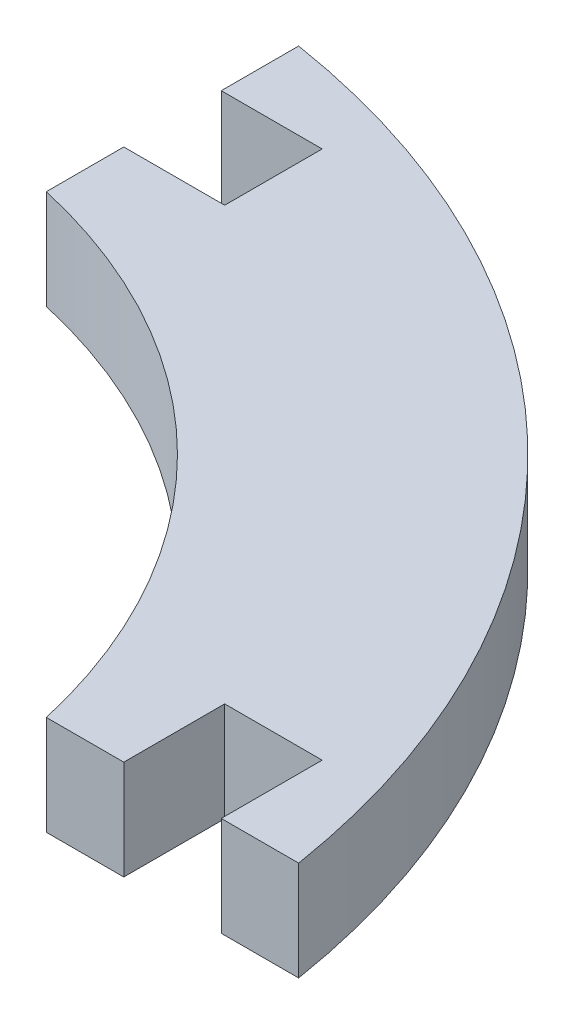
ISO-10303-21;
HEADER;
FILE_DESCRIPTION(('STEP AP214'),'2;1');
FILE_NAME('part.step','',(''),(''),'','','');
FILE_SCHEMA(('AUTOMOTIVE_DESIGN { 1 0 10303 214 1 1 1 1 }'));
ENDSEC;
DATA;
#1=APPLICATION_CONTEXT('core data for automotive mechanical design processes');
#2=APPLICATION_PROTOCOL_DEFINITION('international standard','automotive_design',2000,#1);
#3=PRODUCT_CONTEXT('',#1,'mechanical');
#4=PRODUCT('Part','Part','',(#3));
#5=PRODUCT_RELATED_PRODUCT_CATEGORY('part','',(#4));
#6=PRODUCT_DEFINITION_FORMATION('','',#4);
#7=PRODUCT_DEFINITION_CONTEXT('part definition',#1,'design');
#8=PRODUCT_DEFINITION('design','',#6,#7);
#9=PRODUCT_DEFINITION_SHAPE('','',#8);
#10=(LENGTH_UNIT() NAMED_UNIT(*) SI_UNIT(.MILLI.,.METRE.));
#11=(NAMED_UNIT(*) PLANE_ANGLE_UNIT() SI_UNIT($,.RADIAN.));
#12=(NAMED_UNIT(*) SI_UNIT($,.STERADIAN.) SOLID_ANGLE_UNIT());
#13=UNCERTAINTY_MEASURE_WITH_UNIT(LENGTH_MEASURE(1.E-05),#10,'distance_accuracy_value','');
#14=(GEOMETRIC_REPRESENTATION_CONTEXT(3) GLOBAL_UNCERTAINTY_ASSIGNED_CONTEXT((#13)) GLOBAL_UNIT_ASSIGNED_CONTEXT((#10,
#11,#12)) REPRESENTATION_CONTEXT('',''));
#15=CARTESIAN_POINT('',(0.,0.,0.));
#16=DIRECTION('',(0.,0.,1.));
#17=DIRECTION('',(1.,0.,0.));
#18=AXIS2_PLACEMENT_3D('',#15,#16,#17);
#19=CARTESIAN_POINT('',(19.1614795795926,6.2611,0.));
#20=DIRECTION('',(-1.,0.,0.));
#21=DIRECTION('',(0.,0.,1.));
#22=AXIS2_PLACEMENT_3D('',#19,#20,#21);
#23=PLANE('',#22);
#24=DIRECTION('',(0.,0.,-1.));
#25=VECTOR('',#24,1.);
#26=CARTESIAN_POINT('',(19.1614795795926,0.,0.));
#27=LINE('',#26,#25);
#28=CARTESIAN_POINT('',(19.1614795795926,0.,0.));
#29=VERTEX_POINT('',#28);
#30=CARTESIAN_POINT('',(19.1614795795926,0.,-6.35));
#31=VERTEX_POINT('',#30);
#32=EDGE_CURVE('E153',#29,#31,#27,.T.);
#33=ORIENTED_EDGE('',*,*,#32,.T.);
#34=DIRECTION('',(0.,-1.,0.));
#35=VECTOR('',#34,1.);
#36=CARTESIAN_POINT('',(19.1614795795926,6.2611,-6.35));
#37=LINE('',#36,#35);
#38=CARTESIAN_POINT('',(19.1614795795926,6.2611,-6.35));
#39=VERTEX_POINT('',#38);
#40=EDGE_CURVE('E11',#39,#31,#37,.T.);
#41=ORIENTED_EDGE('',*,*,#40,.F.);
#42=DIRECTION('',(0.,0.,-1.));
#43=VECTOR('',#42,1.);
#44=CARTESIAN_POINT('',(19.1614795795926,6.2611,0.));
#45=LINE('',#44,#43);
#46=CARTESIAN_POINT('',(19.1614795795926,6.2611,0.));
#47=VERTEX_POINT('',#46);
#48=EDGE_CURVE('E175',#47,#39,#45,.T.);
#49=ORIENTED_EDGE('',*,*,#48,.F.);
#50=DIRECTION('',(0.,-1.,0.));
#51=VECTOR('',#50,1.);
#52=CARTESIAN_POINT('',(19.1614795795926,6.2611,0.));
#53=LINE('',#52,#51);
#54=EDGE_CURVE('E149',#47,#29,#53,.T.);
#55=ORIENTED_EDGE('',*,*,#54,.T.);
#56=EDGE_LOOP('',(#33,#41,#49,#55));
#57=FACE_BOUND('',#56,.T.);
#58=ADVANCED_FACE('F33',(#57),#23,.F.);
#59=CARTESIAN_POINT('',(19.1614795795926,6.2611,-6.35));
#60=DIRECTION('',(0.,0.,-1.));
#61=DIRECTION('',(-1.,0.,0.));
#62=AXIS2_PLACEMENT_3D('',#59,#60,#61);
#63=PLANE('',#62);
#64=DIRECTION('',(1.,0.,0.));
#65=VECTOR('',#64,1.);
#66=CARTESIAN_POINT('',(19.1614795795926,0.,-6.35));
#67=LINE('',#66,#65);
#68=CARTESIAN_POINT('',(25.2955795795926,0.,-6.35));
#69=VERTEX_POINT('',#68);
#70=EDGE_CURVE('E156',#31,#69,#67,.T.);
#71=ORIENTED_EDGE('',*,*,#70,.T.);
#72=DIRECTION('',(0.,-1.,0.));
#73=VECTOR('',#72,1.);
#74=CARTESIAN_POINT('',(25.2955795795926,6.2611,-6.35));
#75=LINE('',#74,#73);
#76=CARTESIAN_POINT('',(25.2955795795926,6.2611,-6.35));
#77=VERTEX_POINT('',#76);
#78=EDGE_CURVE('E41',#77,#69,#75,.T.);
#79=ORIENTED_EDGE('',*,*,#78,.F.);
#80=DIRECTION('',(1.,0.,0.));
#81=VECTOR('',#80,1.);
#82=CARTESIAN_POINT('',(19.1614795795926,6.2611,-6.35));
#83=LINE('',#82,#81);
#84=EDGE_CURVE('E104',#39,#77,#83,.T.);
#85=ORIENTED_EDGE('',*,*,#84,.F.);
#86=ORIENTED_EDGE('',*,*,#40,.T.);
#87=EDGE_LOOP('',(#71,#79,#85,#86));
#88=FACE_BOUND('',#87,.T.);
#89=ADVANCED_FACE('F253',(#88),#63,.F.);
#90=CARTESIAN_POINT('',(25.2955795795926,6.2611,0.));
#91=DIRECTION('',(1.,0.,0.));
#92=DIRECTION('',(0.,0.,-1.));
#93=AXIS2_PLACEMENT_3D('',#90,#91,#92);
#94=PLANE('',#93);
#95=DIRECTION('',(0.,0.,1.));
#96=VECTOR('',#95,1.);
#97=CARTESIAN_POINT('',(25.2955795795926,0.,0.));
#98=LINE('',#97,#96);
#99=CARTESIAN_POINT('',(25.2955795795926,0.,0.));
#100=VERTEX_POINT('',#99);
#101=EDGE_CURVE('E158',#69,#100,#98,.T.);
#102=ORIENTED_EDGE('',*,*,#101,.T.);
#103=DIRECTION('',(0.,-1.,0.));
#104=VECTOR('',#103,1.);
#105=CARTESIAN_POINT('',(25.2955795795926,6.2611,0.));
#106=LINE('',#105,#104);
#107=CARTESIAN_POINT('',(25.2955795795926,6.2611,0.));
#108=VERTEX_POINT('',#107);
#109=EDGE_CURVE('E194',#108,#100,#106,.T.);
#110=ORIENTED_EDGE('',*,*,#109,.F.);
#111=DIRECTION('',(0.,0.,1.));
#112=VECTOR('',#111,1.);
#113=CARTESIAN_POINT('',(25.2955795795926,6.2611,0.));
#114=LINE('',#113,#112);
#115=EDGE_CURVE('E202',#77,#108,#114,.T.);
#116=ORIENTED_EDGE('',*,*,#115,.F.);
#117=ORIENTED_EDGE('',*,*,#78,.T.);
#118=EDGE_LOOP('',(#102,#110,#116,#117));
#119=FACE_BOUND('',#118,.T.);
#120=ADVANCED_FACE('F200',(#119),#94,.F.);
#121=CARTESIAN_POINT('',(30.1660295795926,6.2611,0.));
#122=DIRECTION('',(0.,0.,-1.));
#123=DIRECTION('',(-1.,0.,0.));
#124=AXIS2_PLACEMENT_3D('',#121,#122,#123);
#125=PLANE('',#124);
#126=DIRECTION('',(1.,0.,0.));
#127=VECTOR('',#126,1.);
#128=CARTESIAN_POINT('',(30.1660295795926,0.,0.));
#129=LINE('',#128,#127);
#130=CARTESIAN_POINT('',(30.1660295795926,0.,0.));
#131=VERTEX_POINT('',#130);
#132=EDGE_CURVE('E160',#100,#131,#129,.T.);
#133=ORIENTED_EDGE('',*,*,#132,.T.);
#134=DIRECTION('',(0.,-1.,0.));
#135=VECTOR('',#134,1.);
#136=CARTESIAN_POINT('',(30.1660295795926,6.2611,0.));
#137=LINE('',#136,#135);
#138=CARTESIAN_POINT('',(30.1660295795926,6.2611,0.));
#139=VERTEX_POINT('',#138);
#140=EDGE_CURVE('E191',#139,#131,#137,.T.);
#141=ORIENTED_EDGE('',*,*,#140,.F.);
#142=DIRECTION('',(1.,0.,0.));
#143=VECTOR('',#142,1.);
#144=CARTESIAN_POINT('',(30.1660295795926,6.2611,0.));
#145=LINE('',#144,#143);
#146=EDGE_CURVE('E220',#108,#139,#145,.T.);
#147=ORIENTED_EDGE('',*,*,#146,.F.);
#148=ORIENTED_EDGE('',*,*,#109,.T.);
#149=EDGE_LOOP('',(#133,#141,#147,#148));
#150=FACE_BOUND('',#149,.T.);
#151=ADVANCED_FACE('F211',(#150),#125,.F.);
#152=CARTESIAN_POINT('',(-22.8511877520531,6.2611,8.48915141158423));
#153=DIRECTION('',(0.,-1.,0.));
#154=DIRECTION('',(0.,0.,-1.));
#155=AXIS2_PLACEMENT_3D('',#152,#153,#154);
#156=CYLINDRICAL_SURFACE('',#155,53.6925602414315);
#157=CARTESIAN_POINT('',(-22.8511877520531,0.,8.48915141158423));
#158=DIRECTION('',(0.,1.,0.));
#159=DIRECTION('',(0.,0.,-1.));
#160=AXIS2_PLACEMENT_3D('',#157,#158,#159);
#161=CIRCLE('',#160,53.6925602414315);
#162=CARTESIAN_POINT('',(-14.3620363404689,0.,-44.5280659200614));
#163=VERTEX_POINT('',#162);
#164=EDGE_CURVE('E162',#131,#163,#161,.T.);
#165=ORIENTED_EDGE('',*,*,#164,.T.);
#166=DIRECTION('',(0.,-1.,0.));
#167=VECTOR('',#166,1.);
#168=CARTESIAN_POINT('',(-14.3620363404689,6.2611,-44.5280659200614));
#169=LINE('',#168,#167);
#170=CARTESIAN_POINT('',(-14.3620363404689,6.2611,-44.5280659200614));
#171=VERTEX_POINT('',#170);
#172=EDGE_CURVE('E188',#171,#163,#169,.T.);
#173=ORIENTED_EDGE('',*,*,#172,.F.);
#174=CARTESIAN_POINT('',(-22.8511877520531,6.2611,8.48915141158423));
#175=DIRECTION('',(0.,1.,0.));
#176=DIRECTION('',(0.,0.,-1.));
#177=AXIS2_PLACEMENT_3D('',#174,#175,#176);
#178=CIRCLE('',#177,53.6925602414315);
#179=EDGE_CURVE('E217',#139,#171,#178,.T.);
#180=ORIENTED_EDGE('',*,*,#179,.F.);
#181=ORIENTED_EDGE('',*,*,#140,.T.);
#182=EDGE_LOOP('',(#165,#173,#180,#181));
#183=FACE_BOUND('',#182,.T.);
#184=ADVANCED_FACE('F215',(#183),#156,.T.);
#185=CARTESIAN_POINT('',(-14.3620363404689,6.2611,-44.5280659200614));
#186=DIRECTION('',(1.,0.,0.));
#187=DIRECTION('',(0.,0.,-1.));
#188=AXIS2_PLACEMENT_3D('',#185,#186,#187);
#189=PLANE('',#188);
#190=DIRECTION('',(0.,0.,1.));
#191=VECTOR('',#190,1.);
#192=CARTESIAN_POINT('',(-14.3620363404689,0.,-44.5280659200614));
#193=LINE('',#192,#191);
#194=CARTESIAN_POINT('',(-14.3620363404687,0.,-39.6576159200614));
#195=VERTEX_POINT('',#194);
#196=EDGE_CURVE('E164',#163,#195,#193,.T.);
#197=ORIENTED_EDGE('',*,*,#196,.T.);
#198=DIRECTION('',(0.,-1.,0.));
#199=VECTOR('',#198,1.);
#200=CARTESIAN_POINT('',(-14.3620363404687,6.2611,-39.6576159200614));
#201=LINE('',#200,#199);
#202=CARTESIAN_POINT('',(-14.3620363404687,6.2611,-39.6576159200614));
#203=VERTEX_POINT('',#202);
#204=EDGE_CURVE('E185',#203,#195,#201,.T.);
#205=ORIENTED_EDGE('',*,*,#204,.F.);
#206=DIRECTION('',(0.,0.,1.));
#207=VECTOR('',#206,1.);
#208=CARTESIAN_POINT('',(-14.3620363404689,6.2611,-44.5280659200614));
#209=LINE('',#208,#207);
#210=EDGE_CURVE('E219',#171,#203,#209,.T.);
#211=ORIENTED_EDGE('',*,*,#210,.F.);
#212=ORIENTED_EDGE('',*,*,#172,.T.);
#213=EDGE_LOOP('',(#197,#205,#211,#212));
#214=FACE_BOUND('',#213,.T.);
#215=ADVANCED_FACE('F266',(#214),#189,.F.);
#216=CARTESIAN_POINT('',(-8.01203634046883,6.2611,-39.6576159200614));
#217=DIRECTION('',(0.,0.,-1.));
#218=DIRECTION('',(-1.,0.,0.));
#219=AXIS2_PLACEMENT_3D('',#216,#217,#218);
#220=PLANE('',#219);
#221=DIRECTION('',(1.,0.,0.));
#222=VECTOR('',#221,1.);
#223=CARTESIAN_POINT('',(-8.01203634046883,0.,-39.6576159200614));
#224=LINE('',#223,#222);
#225=CARTESIAN_POINT('',(-8.01203634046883,0.,-39.6576159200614));
#226=VERTEX_POINT('',#225);
#227=EDGE_CURVE('E166',#195,#226,#224,.T.);
#228=ORIENTED_EDGE('',*,*,#227,.T.);
#229=DIRECTION('',(0.,-1.,0.));
#230=VECTOR('',#229,1.);
#231=CARTESIAN_POINT('',(-8.01203634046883,6.2611,-39.6576159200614));
#232=LINE('',#231,#230);
#233=CARTESIAN_POINT('',(-8.01203634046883,6.2611,-39.6576159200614));
#234=VERTEX_POINT('',#233);
#235=EDGE_CURVE('E182',#234,#226,#232,.T.);
#236=ORIENTED_EDGE('',*,*,#235,.F.);
#237=DIRECTION('',(1.,0.,0.));
#238=VECTOR('',#237,1.);
#239=CARTESIAN_POINT('',(-8.01203634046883,6.2611,-39.6576159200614));
#240=LINE('',#239,#238);
#241=EDGE_CURVE('E222',#203,#234,#240,.T.);
#242=ORIENTED_EDGE('',*,*,#241,.F.);
#243=ORIENTED_EDGE('',*,*,#204,.T.);
#244=EDGE_LOOP('',(#228,#236,#242,#243));
#245=FACE_BOUND('',#244,.T.);
#246=ADVANCED_FACE('F269',(#245),#220,.F.);
#247=CARTESIAN_POINT('',(-8.01203634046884,6.2611,-33.5235159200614));
#248=DIRECTION('',(1.,0.,0.));
#249=DIRECTION('',(0.,0.,-1.));
#250=AXIS2_PLACEMENT_3D('',#247,#248,#249);
#251=PLANE('',#250);
#252=DIRECTION('',(0.,0.,1.));
#253=VECTOR('',#252,1.);
#254=CARTESIAN_POINT('',(-8.01203634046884,0.,-33.5235159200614));
#255=LINE('',#254,#253);
#256=CARTESIAN_POINT('',(-8.01203634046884,0.,-33.5235159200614));
#257=VERTEX_POINT('',#256);
#258=EDGE_CURVE('E168',#226,#257,#255,.T.);
#259=ORIENTED_EDGE('',*,*,#258,.T.);
#260=DIRECTION('',(0.,-1.,0.));
#261=VECTOR('',#260,1.);
#262=CARTESIAN_POINT('',(-8.01203634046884,6.2611,-33.5235159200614));
#263=LINE('',#262,#261);
#264=CARTESIAN_POINT('',(-8.01203634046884,6.2611,-33.5235159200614));
#265=VERTEX_POINT('',#264);
#266=EDGE_CURVE('E179',#265,#257,#263,.T.);
#267=ORIENTED_EDGE('',*,*,#266,.F.);
#268=DIRECTION('',(0.,0.,1.));
#269=VECTOR('',#268,1.);
#270=CARTESIAN_POINT('',(-8.01203634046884,6.2611,-33.5235159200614));
#271=LINE('',#270,#269);
#272=EDGE_CURVE('E228',#234,#265,#271,.T.);
#273=ORIENTED_EDGE('',*,*,#272,.F.);
#274=ORIENTED_EDGE('',*,*,#235,.T.);
#275=EDGE_LOOP('',(#259,#267,#273,#274));
#276=FACE_BOUND('',#275,.T.);
#277=ADVANCED_FACE('F234',(#276),#251,.F.);
#278=CARTESIAN_POINT('',(-8.01203634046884,6.2611,-33.5235159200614));
#279=DIRECTION('',(0.,0.,1.));
#280=DIRECTION('',(1.,0.,0.));
#281=AXIS2_PLACEMENT_3D('',#278,#279,#280);
#282=PLANE('',#281);
#283=DIRECTION('',(-1.,0.,0.));
#284=VECTOR('',#283,1.);
#285=CARTESIAN_POINT('',(-8.01203634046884,0.,-33.5235159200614));
#286=LINE('',#285,#284);
#287=CARTESIAN_POINT('',(-14.3620363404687,0.,-33.5235159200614));
#288=VERTEX_POINT('',#287);
#289=EDGE_CURVE('E170',#257,#288,#286,.T.);
#290=ORIENTED_EDGE('',*,*,#289,.T.);
#291=DIRECTION('',(0.,-1.,0.));
#292=VECTOR('',#291,1.);
#293=CARTESIAN_POINT('',(-14.3620363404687,6.2611,-33.5235159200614));
#294=LINE('',#293,#292);
#295=CARTESIAN_POINT('',(-14.3620363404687,6.2611,-33.5235159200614));
#296=VERTEX_POINT('',#295);
#297=EDGE_CURVE('E144',#296,#288,#294,.T.);
#298=ORIENTED_EDGE('',*,*,#297,.F.);
#299=DIRECTION('',(-1.,0.,0.));
#300=VECTOR('',#299,1.);
#301=CARTESIAN_POINT('',(-8.01203634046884,6.2611,-33.5235159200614));
#302=LINE('',#301,#300);
#303=EDGE_CURVE('E135',#265,#296,#302,.T.);
#304=ORIENTED_EDGE('',*,*,#303,.F.);
#305=ORIENTED_EDGE('',*,*,#266,.T.);
#306=EDGE_LOOP('',(#290,#298,#304,#305));
#307=FACE_BOUND('',#306,.T.);
#308=ADVANCED_FACE('F238',(#307),#282,.F.);
#309=CARTESIAN_POINT('',(-14.3620363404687,6.2611,-33.5235159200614));
#310=DIRECTION('',(1.,0.,0.));
#311=DIRECTION('',(0.,0.,-1.));
#312=AXIS2_PLACEMENT_3D('',#309,#310,#311);
#313=PLANE('',#312);
#314=DIRECTION('',(0.,0.,1.));
#315=VECTOR('',#314,1.);
#316=CARTESIAN_POINT('',(-14.3620363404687,0.,-33.5235159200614));
#317=LINE('',#316,#315);
#318=CARTESIAN_POINT('',(-14.3620363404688,0.,-28.6530659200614));
#319=VERTEX_POINT('',#318);
#320=EDGE_CURVE('E143',#288,#319,#317,.T.);
#321=ORIENTED_EDGE('',*,*,#320,.T.);
#322=DIRECTION('',(0.,-1.,0.));
#323=VECTOR('',#322,1.);
#324=CARTESIAN_POINT('',(-14.3620363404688,6.2611,-28.6530659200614));
#325=LINE('',#324,#323);
#326=CARTESIAN_POINT('',(-14.3620363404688,6.2611,-28.6530659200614));
#327=VERTEX_POINT('',#326);
#328=EDGE_CURVE('E140',#327,#319,#325,.T.);
#329=ORIENTED_EDGE('',*,*,#328,.F.);
#330=DIRECTION('',(0.,0.,1.));
#331=VECTOR('',#330,1.);
#332=CARTESIAN_POINT('',(-14.3620363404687,6.2611,-33.5235159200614));
#333=LINE('',#332,#331);
#334=EDGE_CURVE('E129',#296,#327,#333,.T.);
#335=ORIENTED_EDGE('',*,*,#334,.F.);
#336=ORIENTED_EDGE('',*,*,#297,.T.);
#337=EDGE_LOOP('',(#321,#329,#335,#336));
#338=FACE_BOUND('',#337,.T.);
#339=ADVANCED_FACE('F141',(#338),#313,.F.);
#340=CARTESIAN_POINT('',(-22.8511877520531,6.2611,8.48915141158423));
#341=DIRECTION('',(0.,-1.,0.));
#342=DIRECTION('',(0.,0.,-1.));
#343=AXIS2_PLACEMENT_3D('',#340,#341,#342);
#344=CYLINDRICAL_SURFACE('',#343,38.1);
#345=CARTESIAN_POINT('',(-22.8511877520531,0.,8.48915141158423));
#346=DIRECTION('',(0.,-1.,0.));
#347=DIRECTION('',(0.,0.,-1.));
#348=AXIS2_PLACEMENT_3D('',#345,#346,#347);
#349=CIRCLE('',#348,38.1);
#350=CARTESIAN_POINT('',(14.2910295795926,0.,0.));
#351=VERTEX_POINT('',#350);
#352=EDGE_CURVE('E90',#319,#351,#349,.T.);
#353=ORIENTED_EDGE('',*,*,#352,.T.);
#354=DIRECTION('',(0.,-1.,0.));
#355=VECTOR('',#354,1.);
#356=CARTESIAN_POINT('',(14.2910295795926,6.2611,0.));
#357=LINE('',#356,#355);
#358=CARTESIAN_POINT('',(14.2910295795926,6.2611,0.));
#359=VERTEX_POINT('',#358);
#360=EDGE_CURVE('E145',#359,#351,#357,.T.);
#361=ORIENTED_EDGE('',*,*,#360,.F.);
#362=CARTESIAN_POINT('',(-22.8511877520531,6.2611,8.48915141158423));
#363=DIRECTION('',(0.,-1.,0.));
#364=DIRECTION('',(0.,0.,-1.));
#365=AXIS2_PLACEMENT_3D('',#362,#363,#364);
#366=CIRCLE('',#365,38.1);
#367=EDGE_CURVE('E133',#327,#359,#366,.T.);
#368=ORIENTED_EDGE('',*,*,#367,.F.);
#369=ORIENTED_EDGE('',*,*,#328,.T.);
#370=EDGE_LOOP('',(#353,#361,#368,#369));
#371=FACE_BOUND('',#370,.T.);
#372=ADVANCED_FACE('F147',(#371),#344,.F.);
#373=CARTESIAN_POINT('',(19.1614795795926,6.2611,0.));
#374=DIRECTION('',(0.,0.,-1.));
#375=DIRECTION('',(-1.,0.,0.));
#376=AXIS2_PLACEMENT_3D('',#373,#374,#375);
#377=PLANE('',#376);
#378=DIRECTION('',(1.,0.,0.));
#379=VECTOR('',#378,1.);
#380=CARTESIAN_POINT('',(19.1614795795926,0.,0.));
#381=LINE('',#380,#379);
#382=EDGE_CURVE('E96',#351,#29,#381,.T.);
#383=ORIENTED_EDGE('',*,*,#382,.T.);
#384=ORIENTED_EDGE('',*,*,#54,.F.);
#385=DIRECTION('',(1.,0.,0.));
#386=VECTOR('',#385,1.);
#387=CARTESIAN_POINT('',(19.1614795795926,6.2611,0.));
#388=LINE('',#387,#386);
#389=EDGE_CURVE('E49',#359,#47,#388,.T.);
#390=ORIENTED_EDGE('',*,*,#389,.F.);
#391=ORIENTED_EDGE('',*,*,#360,.T.);
#392=EDGE_LOOP('',(#383,#384,#390,#391));
#393=FACE_BOUND('',#392,.T.);
#394=ADVANCED_FACE('F242',(#393),#377,.F.);
#395=CARTESIAN_POINT('',(-22.8511877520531,6.2611,8.48915141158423));
#396=DIRECTION('',(0.,-1.,0.));
#397=DIRECTION('',(0.,0.,-1.));
#398=AXIS2_PLACEMENT_3D('',#395,#396,#397);
#399=PLANE('',#398);
#400=ORIENTED_EDGE('',*,*,#48,.T.);
#401=ORIENTED_EDGE('',*,*,#84,.T.);
#402=ORIENTED_EDGE('',*,*,#115,.T.);
#403=ORIENTED_EDGE('',*,*,#146,.T.);
#404=ORIENTED_EDGE('',*,*,#179,.T.);
#405=ORIENTED_EDGE('',*,*,#210,.T.);
#406=ORIENTED_EDGE('',*,*,#241,.T.);
#407=ORIENTED_EDGE('',*,*,#272,.T.);
#408=ORIENTED_EDGE('',*,*,#303,.T.);
#409=ORIENTED_EDGE('',*,*,#334,.T.);
#410=ORIENTED_EDGE('',*,*,#367,.T.);
#411=ORIENTED_EDGE('',*,*,#389,.T.);
#412=EDGE_LOOP('',(#400,#401,#402,#403,#404,#405,#406,#407,#408,#409,#410,#411));
#413=FACE_BOUND('',#412,.T.);
#414=ADVANCED_FACE('F131',(#413),#399,.F.);
#415=CARTESIAN_POINT('',(-22.8511877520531,0.,8.48915141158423));
#416=DIRECTION('',(0.,-1.,0.));
#417=DIRECTION('',(0.,0.,-1.));
#418=AXIS2_PLACEMENT_3D('',#415,#416,#417);
#419=PLANE('',#418);
#420=ORIENTED_EDGE('',*,*,#32,.F.);
#421=ORIENTED_EDGE('',*,*,#382,.F.);
#422=ORIENTED_EDGE('',*,*,#352,.F.);
#423=ORIENTED_EDGE('',*,*,#320,.F.);
#424=ORIENTED_EDGE('',*,*,#289,.F.);
#425=ORIENTED_EDGE('',*,*,#258,.F.);
#426=ORIENTED_EDGE('',*,*,#227,.F.);
#427=ORIENTED_EDGE('',*,*,#196,.F.);
#428=ORIENTED_EDGE('',*,*,#164,.F.);
#429=ORIENTED_EDGE('',*,*,#132,.F.);
#430=ORIENTED_EDGE('',*,*,#101,.F.);
#431=ORIENTED_EDGE('',*,*,#70,.F.);
#432=EDGE_LOOP('',(#420,#421,#422,#423,#424,#425,#426,#427,#428,#429,#430,#431));
#433=FACE_BOUND('',#432,.T.);
#434=ADVANCED_FACE('F206',(#433),#419,.T.);
#435=CLOSED_SHELL('',(#58,#89,#120,#151,#184,#215,#246,#277,#308,#339,#372,#394,#414,#434));
#436=MANIFOLD_SOLID_BREP('B2',#435);
#437=ADVANCED_BREP_SHAPE_REPRESENTATION('',(#18,#436),#14);
#438=SHAPE_DEFINITION_REPRESENTATION(#9,#437);
ENDSEC;
END-ISO-10303-21;
